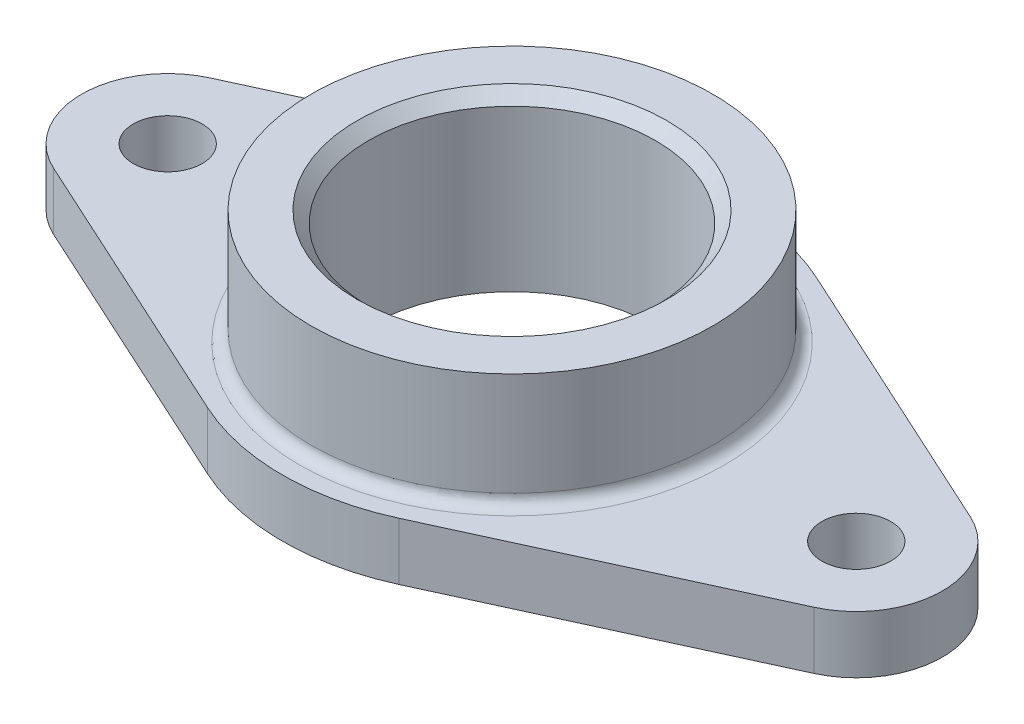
ISO-10303-21;
HEADER;
FILE_DESCRIPTION(('STEP AP214'),'2;1');
FILE_NAME('part.step','',(''),(''),'','','');
FILE_SCHEMA(('AUTOMOTIVE_DESIGN { 1 0 10303 214 1 1 1 1 }'));
ENDSEC;
DATA;
#1=APPLICATION_CONTEXT('core data for automotive mechanical design processes');
#2=APPLICATION_PROTOCOL_DEFINITION('international standard','automotive_design',2000,#1);
#3=PRODUCT_CONTEXT('',#1,'mechanical');
#4=PRODUCT('Part','Part','',(#3));
#5=PRODUCT_RELATED_PRODUCT_CATEGORY('part','',(#4));
#6=PRODUCT_DEFINITION_FORMATION('','',#4);
#7=PRODUCT_DEFINITION_CONTEXT('part definition',#1,'design');
#8=PRODUCT_DEFINITION('design','',#6,#7);
#9=PRODUCT_DEFINITION_SHAPE('','',#8);
#10=(LENGTH_UNIT() NAMED_UNIT(*) SI_UNIT(.MILLI.,.METRE.));
#11=(NAMED_UNIT(*) PLANE_ANGLE_UNIT() SI_UNIT($,.RADIAN.));
#12=(NAMED_UNIT(*) SI_UNIT($,.STERADIAN.) SOLID_ANGLE_UNIT());
#13=UNCERTAINTY_MEASURE_WITH_UNIT(LENGTH_MEASURE(1.E-05),#10,'distance_accuracy_value','');
#14=(GEOMETRIC_REPRESENTATION_CONTEXT(3) GLOBAL_UNCERTAINTY_ASSIGNED_CONTEXT((#13)) GLOBAL_UNIT_ASSIGNED_CONTEXT((#10,
#11,#12)) REPRESENTATION_CONTEXT('',''));
#15=CARTESIAN_POINT('',(0.,0.,0.));
#16=DIRECTION('',(0.,0.,1.));
#17=DIRECTION('',(1.,0.,0.));
#18=AXIS2_PLACEMENT_3D('',#15,#16,#17);
#19=CARTESIAN_POINT('',(-60.,0.,0.));
#20=DIRECTION('',(0.,1.,0.));
#21=DIRECTION('',(0.,0.,1.));
#22=AXIS2_PLACEMENT_3D('',#19,#20,#21);
#23=PLANE('',#22);
#24=CARTESIAN_POINT('',(-60.,0.,0.));
#25=DIRECTION('',(0.,1.,0.));
#26=DIRECTION('',(0.,0.,1.));
#27=AXIS2_PLACEMENT_3D('',#24,#25,#26);
#28=CIRCLE('',#27,6.);
#29=CARTESIAN_POINT('',(-60.,0.,6.));
#30=VERTEX_POINT('',#29);
#31=EDGE_CURVE('E164',#30,#30,#28,.T.);
#32=ORIENTED_EDGE('',*,*,#31,.T.);
#33=EDGE_LOOP('',(#32));
#34=FACE_BOUND('',#33,.T.);
#35=CARTESIAN_POINT('',(-60.,0.,0.));
#36=DIRECTION('',(0.,1.,0.));
#37=DIRECTION('',(0.,0.,1.));
#38=AXIS2_PLACEMENT_3D('',#35,#36,#37);
#39=CIRCLE('',#38,15.);
#40=CARTESIAN_POINT('',(-66.25,0.,-13.6358901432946));
#41=VERTEX_POINT('',#40);
#42=CARTESIAN_POINT('',(-66.25,0.,13.6358901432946));
#43=VERTEX_POINT('',#42);
#44=EDGE_CURVE('E129',#41,#43,#39,.T.);
#45=ORIENTED_EDGE('',*,*,#44,.F.);
#46=DIRECTION('',(-0.90905934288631,0.,0.416666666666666));
#47=VECTOR('',#46,1.);
#48=CARTESIAN_POINT('',(-66.25,0.,-13.6358901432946));
#49=LINE('',#48,#47);
#50=CARTESIAN_POINT('',(-16.6666666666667,0.,-36.3623737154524));
#51=VERTEX_POINT('',#50);
#52=EDGE_CURVE('E82',#51,#41,#49,.T.);
#53=ORIENTED_EDGE('',*,*,#52,.F.);
#54=CARTESIAN_POINT('',(0.,0.,0.));
#55=DIRECTION('',(0.,1.,0.));
#56=DIRECTION('',(0.,0.,1.));
#57=AXIS2_PLACEMENT_3D('',#54,#55,#56);
#58=CIRCLE('',#57,40.);
#59=CARTESIAN_POINT('',(16.6666666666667,0.,-36.3623737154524));
#60=VERTEX_POINT('',#59);
#61=EDGE_CURVE('E76',#60,#51,#58,.T.);
#62=ORIENTED_EDGE('',*,*,#61,.F.);
#63=DIRECTION('',(-0.90905934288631,0.,-0.416666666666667));
#64=VECTOR('',#63,1.);
#65=CARTESIAN_POINT('',(16.6666666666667,0.,-36.3623737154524));
#66=LINE('',#65,#64);
#67=CARTESIAN_POINT('',(66.25,0.,-13.6358901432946));
#68=VERTEX_POINT('',#67);
#69=EDGE_CURVE('E119',#68,#60,#66,.T.);
#70=ORIENTED_EDGE('',*,*,#69,.F.);
#71=CARTESIAN_POINT('',(60.,0.,0.));
#72=DIRECTION('',(0.,1.,0.));
#73=DIRECTION('',(0.,0.,1.));
#74=AXIS2_PLACEMENT_3D('',#71,#72,#73);
#75=CIRCLE('',#74,15.);
#76=CARTESIAN_POINT('',(66.25,0.,13.6358901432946));
#77=VERTEX_POINT('',#76);
#78=EDGE_CURVE('E139',#77,#68,#75,.T.);
#79=ORIENTED_EDGE('',*,*,#78,.F.);
#80=DIRECTION('',(0.90905934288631,0.,-0.416666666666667));
#81=VECTOR('',#80,1.);
#82=CARTESIAN_POINT('',(16.6666666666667,0.,36.3623737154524));
#83=LINE('',#82,#81);
#84=CARTESIAN_POINT('',(16.6666666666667,0.,36.3623737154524));
#85=VERTEX_POINT('',#84);
#86=EDGE_CURVE('E137',#85,#77,#83,.T.);
#87=ORIENTED_EDGE('',*,*,#86,.F.);
#88=CARTESIAN_POINT('',(0.,0.,0.));
#89=DIRECTION('',(0.,1.,0.));
#90=DIRECTION('',(0.,0.,1.));
#91=AXIS2_PLACEMENT_3D('',#88,#89,#90);
#92=CIRCLE('',#91,40.);
#93=CARTESIAN_POINT('',(-16.6666666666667,0.,36.3623737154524));
#94=VERTEX_POINT('',#93);
#95=EDGE_CURVE('E135',#94,#85,#92,.T.);
#96=ORIENTED_EDGE('',*,*,#95,.F.);
#97=DIRECTION('',(0.90905934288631,0.,0.416666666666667));
#98=VECTOR('',#97,1.);
#99=CARTESIAN_POINT('',(-66.25,0.,13.6358901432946));
#100=LINE('',#99,#98);
#101=EDGE_CURVE('E132',#43,#94,#100,.T.);
#102=ORIENTED_EDGE('',*,*,#101,.F.);
#103=EDGE_LOOP('',(#45,#53,#62,#70,#79,#87,#96,#102));
#104=FACE_BOUND('',#103,.T.);
#105=CARTESIAN_POINT('',(0.,0.,0.));
#106=DIRECTION('',(0.,1.,0.));
#107=DIRECTION('',(0.,0.,1.));
#108=AXIS2_PLACEMENT_3D('',#105,#106,#107);
#109=CIRCLE('',#108,25.);
#110=CARTESIAN_POINT('',(0.,0.,25.));
#111=VERTEX_POINT('',#110);
#112=EDGE_CURVE('E163',#111,#111,#109,.T.);
#113=ORIENTED_EDGE('',*,*,#112,.T.);
#114=EDGE_LOOP('',(#113));
#115=FACE_BOUND('',#114,.T.);
#116=CARTESIAN_POINT('',(60.,0.,0.));
#117=DIRECTION('',(0.,1.,0.));
#118=DIRECTION('',(0.,0.,1.));
#119=AXIS2_PLACEMENT_3D('',#116,#117,#118);
#120=CIRCLE('',#119,6.);
#121=CARTESIAN_POINT('',(60.,0.,6.));
#122=VERTEX_POINT('',#121);
#123=EDGE_CURVE('E168',#122,#122,#120,.T.);
#124=ORIENTED_EDGE('',*,*,#123,.T.);
#125=EDGE_LOOP('',(#124));
#126=FACE_BOUND('',#125,.T.);
#127=ADVANCED_FACE('F30',(#34,#104,#115,#126),#23,.F.);
#128=CARTESIAN_POINT('',(-60.,10.,0.));
#129=DIRECTION('',(0.,1.,0.));
#130=DIRECTION('',(0.,0.,1.));
#131=AXIS2_PLACEMENT_3D('',#128,#129,#130);
#132=PLANE('',#131);
#133=CARTESIAN_POINT('',(0.,10.,0.));
#134=DIRECTION('',(0.,1.,0.));
#135=DIRECTION('',(0.,0.,1.));
#136=AXIS2_PLACEMENT_3D('',#133,#134,#135);
#137=CIRCLE('',#136,37.);
#138=CARTESIAN_POINT('',(0.,10.,37.));
#139=VERTEX_POINT('',#138);
#140=EDGE_CURVE('E39',#139,#139,#137,.F.);
#141=ORIENTED_EDGE('',*,*,#140,.T.);
#142=EDGE_LOOP('',(#141));
#143=FACE_BOUND('',#142,.T.);
#144=CARTESIAN_POINT('',(-60.,10.,0.));
#145=DIRECTION('',(0.,1.,0.));
#146=DIRECTION('',(0.,0.,1.));
#147=AXIS2_PLACEMENT_3D('',#144,#145,#146);
#148=CIRCLE('',#147,6.);
#149=CARTESIAN_POINT('',(-60.,10.,6.));
#150=VERTEX_POINT('',#149);
#151=EDGE_CURVE('E160',#150,#150,#148,.F.);
#152=ORIENTED_EDGE('',*,*,#151,.T.);
#153=EDGE_LOOP('',(#152));
#154=FACE_BOUND('',#153,.T.);
#155=CARTESIAN_POINT('',(-60.,10.,0.));
#156=DIRECTION('',(0.,1.,0.));
#157=DIRECTION('',(0.,0.,1.));
#158=AXIS2_PLACEMENT_3D('',#155,#156,#157);
#159=CIRCLE('',#158,15.);
#160=CARTESIAN_POINT('',(-66.25,10.,-13.6358901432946));
#161=VERTEX_POINT('',#160);
#162=CARTESIAN_POINT('',(-66.25,10.,13.6358901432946));
#163=VERTEX_POINT('',#162);
#164=EDGE_CURVE('E144',#161,#163,#159,.T.);
#165=ORIENTED_EDGE('',*,*,#164,.T.);
#166=DIRECTION('',(0.90905934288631,0.,0.416666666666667));
#167=VECTOR('',#166,1.);
#168=CARTESIAN_POINT('',(-66.25,10.,13.6358901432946));
#169=LINE('',#168,#167);
#170=CARTESIAN_POINT('',(-16.6666666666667,10.,36.3623737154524));
#171=VERTEX_POINT('',#170);
#172=EDGE_CURVE('E91',#163,#171,#169,.T.);
#173=ORIENTED_EDGE('',*,*,#172,.T.);
#174=CARTESIAN_POINT('',(0.,10.,0.));
#175=DIRECTION('',(0.,1.,0.));
#176=DIRECTION('',(0.,0.,1.));
#177=AXIS2_PLACEMENT_3D('',#174,#175,#176);
#178=CIRCLE('',#177,40.);
#179=CARTESIAN_POINT('',(16.6666666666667,10.,36.3623737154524));
#180=VERTEX_POINT('',#179);
#181=EDGE_CURVE('E238',#171,#180,#178,.T.);
#182=ORIENTED_EDGE('',*,*,#181,.T.);
#183=DIRECTION('',(0.90905934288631,0.,-0.416666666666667));
#184=VECTOR('',#183,1.);
#185=CARTESIAN_POINT('',(16.6666666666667,10.,36.3623737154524));
#186=LINE('',#185,#184);
#187=CARTESIAN_POINT('',(66.25,10.,13.6358901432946));
#188=VERTEX_POINT('',#187);
#189=EDGE_CURVE('E240',#180,#188,#186,.T.);
#190=ORIENTED_EDGE('',*,*,#189,.T.);
#191=CARTESIAN_POINT('',(60.,10.,0.));
#192=DIRECTION('',(0.,1.,0.));
#193=DIRECTION('',(0.,0.,1.));
#194=AXIS2_PLACEMENT_3D('',#191,#192,#193);
#195=CIRCLE('',#194,15.);
#196=CARTESIAN_POINT('',(66.25,10.,-13.6358901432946));
#197=VERTEX_POINT('',#196);
#198=EDGE_CURVE('E111',#188,#197,#195,.T.);
#199=ORIENTED_EDGE('',*,*,#198,.T.);
#200=DIRECTION('',(-0.90905934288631,0.,-0.416666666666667));
#201=VECTOR('',#200,1.);
#202=CARTESIAN_POINT('',(16.6666666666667,10.,-36.3623737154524));
#203=LINE('',#202,#201);
#204=CARTESIAN_POINT('',(16.6666666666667,10.,-36.3623737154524));
#205=VERTEX_POINT('',#204);
#206=EDGE_CURVE('E104',#197,#205,#203,.T.);
#207=ORIENTED_EDGE('',*,*,#206,.T.);
#208=CARTESIAN_POINT('',(0.,10.,0.));
#209=DIRECTION('',(0.,1.,0.));
#210=DIRECTION('',(0.,0.,1.));
#211=AXIS2_PLACEMENT_3D('',#208,#209,#210);
#212=CIRCLE('',#211,40.);
#213=CARTESIAN_POINT('',(-16.6666666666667,10.,-36.3623737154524));
#214=VERTEX_POINT('',#213);
#215=EDGE_CURVE('E109',#205,#214,#212,.T.);
#216=ORIENTED_EDGE('',*,*,#215,.T.);
#217=DIRECTION('',(-0.90905934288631,0.,0.416666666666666));
#218=VECTOR('',#217,1.);
#219=CARTESIAN_POINT('',(-66.25,10.,-13.6358901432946));
#220=LINE('',#219,#218);
#221=EDGE_CURVE('E47',#214,#161,#220,.T.);
#222=ORIENTED_EDGE('',*,*,#221,.T.);
#223=EDGE_LOOP('',(#165,#173,#182,#190,#199,#207,#216,#222));
#224=FACE_BOUND('',#223,.T.);
#225=CARTESIAN_POINT('',(60.,10.,0.));
#226=DIRECTION('',(0.,1.,0.));
#227=DIRECTION('',(0.,0.,1.));
#228=AXIS2_PLACEMENT_3D('',#225,#226,#227);
#229=CIRCLE('',#228,6.);
#230=CARTESIAN_POINT('',(60.,10.,6.));
#231=VERTEX_POINT('',#230);
#232=EDGE_CURVE('E165',#231,#231,#229,.F.);
#233=ORIENTED_EDGE('',*,*,#232,.T.);
#234=EDGE_LOOP('',(#233));
#235=FACE_BOUND('',#234,.T.);
#236=ADVANCED_FACE('F106',(#143,#154,#224,#235),#132,.T.);
#237=CARTESIAN_POINT('',(0.,30.,0.));
#238=DIRECTION('',(0.,1.,0.));
#239=DIRECTION('',(0.,0.,1.));
#240=AXIS2_PLACEMENT_3D('',#237,#238,#239);
#241=PLANE('',#240);
#242=CARTESIAN_POINT('',(0.,30.,0.));
#243=DIRECTION('',(0.,1.,0.));
#244=DIRECTION('',(0.,0.,1.));
#245=AXIS2_PLACEMENT_3D('',#242,#243,#244);
#246=CIRCLE('',#245,27.);
#247=CARTESIAN_POINT('',(0.,30.,27.));
#248=VERTEX_POINT('',#247);
#249=EDGE_CURVE('E171',#248,#248,#246,.F.);
#250=ORIENTED_EDGE('',*,*,#249,.T.);
#251=EDGE_LOOP('',(#250));
#252=FACE_BOUND('',#251,.T.);
#253=CARTESIAN_POINT('',(0.,30.,0.));
#254=DIRECTION('',(0.,1.,0.));
#255=DIRECTION('',(0.,0.,1.));
#256=AXIS2_PLACEMENT_3D('',#253,#254,#255);
#257=CIRCLE('',#256,35.);
#258=CARTESIAN_POINT('',(0.,30.,35.));
#259=VERTEX_POINT('',#258);
#260=EDGE_CURVE('E133',#259,#259,#257,.T.);
#261=ORIENTED_EDGE('',*,*,#260,.T.);
#262=EDGE_LOOP('',(#261));
#263=FACE_BOUND('',#262,.T.);
#264=ADVANCED_FACE('F193',(#252,#263),#241,.T.);
#265=CARTESIAN_POINT('',(-60.,10.,0.));
#266=DIRECTION('',(0.,-1.,0.));
#267=DIRECTION('',(0.,0.,-1.));
#268=AXIS2_PLACEMENT_3D('',#265,#266,#267);
#269=CYLINDRICAL_SURFACE('',#268,15.);
#270=ORIENTED_EDGE('',*,*,#44,.T.);
#271=DIRECTION('',(0.,-1.,0.));
#272=VECTOR('',#271,1.);
#273=CARTESIAN_POINT('',(-66.25,10.,13.6358901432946));
#274=LINE('',#273,#272);
#275=EDGE_CURVE('E157',#163,#43,#274,.T.);
#276=ORIENTED_EDGE('',*,*,#275,.F.);
#277=ORIENTED_EDGE('',*,*,#164,.F.);
#278=DIRECTION('',(0.,-1.,0.));
#279=VECTOR('',#278,1.);
#280=CARTESIAN_POINT('',(-66.25,10.,-13.6358901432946));
#281=LINE('',#280,#279);
#282=EDGE_CURVE('E125',#161,#41,#281,.T.);
#283=ORIENTED_EDGE('',*,*,#282,.T.);
#284=EDGE_LOOP('',(#270,#276,#277,#283));
#285=FACE_BOUND('',#284,.T.);
#286=ADVANCED_FACE('F222',(#285),#269,.T.);
#287=CARTESIAN_POINT('',(-66.25,10.,13.6358901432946));
#288=DIRECTION('',(0.416666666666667,0.,-0.90905934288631));
#289=DIRECTION('',(-0.90905934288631,0.,-0.416666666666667));
#290=AXIS2_PLACEMENT_3D('',#287,#288,#289);
#291=PLANE('',#290);
#292=ORIENTED_EDGE('',*,*,#101,.T.);
#293=DIRECTION('',(0.,-1.,0.));
#294=VECTOR('',#293,1.);
#295=CARTESIAN_POINT('',(-16.6666666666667,10.,36.3623737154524));
#296=LINE('',#295,#294);
#297=EDGE_CURVE('E154',#171,#94,#296,.T.);
#298=ORIENTED_EDGE('',*,*,#297,.F.);
#299=ORIENTED_EDGE('',*,*,#172,.F.);
#300=ORIENTED_EDGE('',*,*,#275,.T.);
#301=EDGE_LOOP('',(#292,#298,#299,#300));
#302=FACE_BOUND('',#301,.T.);
#303=ADVANCED_FACE('F218',(#302),#291,.F.);
#304=CARTESIAN_POINT('',(0.,10.,0.));
#305=DIRECTION('',(0.,-1.,0.));
#306=DIRECTION('',(0.,0.,-1.));
#307=AXIS2_PLACEMENT_3D('',#304,#305,#306);
#308=CYLINDRICAL_SURFACE('',#307,40.);
#309=ORIENTED_EDGE('',*,*,#95,.T.);
#310=DIRECTION('',(0.,-1.,0.));
#311=VECTOR('',#310,1.);
#312=CARTESIAN_POINT('',(16.6666666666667,10.,36.3623737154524));
#313=LINE('',#312,#311);
#314=EDGE_CURVE('E151',#180,#85,#313,.T.);
#315=ORIENTED_EDGE('',*,*,#314,.F.);
#316=ORIENTED_EDGE('',*,*,#181,.F.);
#317=ORIENTED_EDGE('',*,*,#297,.T.);
#318=EDGE_LOOP('',(#309,#315,#316,#317));
#319=FACE_BOUND('',#318,.T.);
#320=ADVANCED_FACE('F214',(#319),#308,.T.);
#321=CARTESIAN_POINT('',(16.6666666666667,10.,36.3623737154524));
#322=DIRECTION('',(-0.416666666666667,0.,-0.90905934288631));
#323=DIRECTION('',(-0.90905934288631,0.,0.416666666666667));
#324=AXIS2_PLACEMENT_3D('',#321,#322,#323);
#325=PLANE('',#324);
#326=ORIENTED_EDGE('',*,*,#86,.T.);
#327=DIRECTION('',(0.,-1.,0.));
#328=VECTOR('',#327,1.);
#329=CARTESIAN_POINT('',(66.25,10.,13.6358901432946));
#330=LINE('',#329,#328);
#331=EDGE_CURVE('E148',#188,#77,#330,.T.);
#332=ORIENTED_EDGE('',*,*,#331,.F.);
#333=ORIENTED_EDGE('',*,*,#189,.F.);
#334=ORIENTED_EDGE('',*,*,#314,.T.);
#335=EDGE_LOOP('',(#326,#332,#333,#334));
#336=FACE_BOUND('',#335,.T.);
#337=ADVANCED_FACE('F210',(#336),#325,.F.);
#338=CARTESIAN_POINT('',(60.,10.,0.));
#339=DIRECTION('',(0.,-1.,0.));
#340=DIRECTION('',(0.,0.,-1.));
#341=AXIS2_PLACEMENT_3D('',#338,#339,#340);
#342=CYLINDRICAL_SURFACE('',#341,15.);
#343=ORIENTED_EDGE('',*,*,#78,.T.);
#344=DIRECTION('',(0.,-1.,0.));
#345=VECTOR('',#344,1.);
#346=CARTESIAN_POINT('',(66.25,10.,-13.6358901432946));
#347=LINE('',#346,#345);
#348=EDGE_CURVE('E120',#197,#68,#347,.T.);
#349=ORIENTED_EDGE('',*,*,#348,.F.);
#350=ORIENTED_EDGE('',*,*,#198,.F.);
#351=ORIENTED_EDGE('',*,*,#331,.T.);
#352=EDGE_LOOP('',(#343,#349,#350,#351));
#353=FACE_BOUND('',#352,.T.);
#354=ADVANCED_FACE('F207',(#353),#342,.T.);
#355=CARTESIAN_POINT('',(16.6666666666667,10.,-36.3623737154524));
#356=DIRECTION('',(-0.416666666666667,0.,0.90905934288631));
#357=DIRECTION('',(0.90905934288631,0.,0.416666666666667));
#358=AXIS2_PLACEMENT_3D('',#355,#356,#357);
#359=PLANE('',#358);
#360=ORIENTED_EDGE('',*,*,#69,.T.);
#361=DIRECTION('',(0.,-1.,0.));
#362=VECTOR('',#361,1.);
#363=CARTESIAN_POINT('',(16.6666666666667,10.,-36.3623737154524));
#364=LINE('',#363,#362);
#365=EDGE_CURVE('E116',#205,#60,#364,.T.);
#366=ORIENTED_EDGE('',*,*,#365,.F.);
#367=ORIENTED_EDGE('',*,*,#206,.F.);
#368=ORIENTED_EDGE('',*,*,#348,.T.);
#369=EDGE_LOOP('',(#360,#366,#367,#368));
#370=FACE_BOUND('',#369,.T.);
#371=ADVANCED_FACE('F117',(#370),#359,.F.);
#372=CARTESIAN_POINT('',(0.,10.,0.));
#373=DIRECTION('',(0.,-1.,0.));
#374=DIRECTION('',(0.,0.,-1.));
#375=AXIS2_PLACEMENT_3D('',#372,#373,#374);
#376=CYLINDRICAL_SURFACE('',#375,40.);
#377=ORIENTED_EDGE('',*,*,#61,.T.);
#378=DIRECTION('',(0.,-1.,0.));
#379=VECTOR('',#378,1.);
#380=CARTESIAN_POINT('',(-16.6666666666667,10.,-36.3623737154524));
#381=LINE('',#380,#379);
#382=EDGE_CURVE('E121',#214,#51,#381,.T.);
#383=ORIENTED_EDGE('',*,*,#382,.F.);
#384=ORIENTED_EDGE('',*,*,#215,.F.);
#385=ORIENTED_EDGE('',*,*,#365,.T.);
#386=EDGE_LOOP('',(#377,#383,#384,#385));
#387=FACE_BOUND('',#386,.T.);
#388=ADVANCED_FACE('F123',(#387),#376,.T.);
#389=CARTESIAN_POINT('',(-66.25,10.,-13.6358901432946));
#390=DIRECTION('',(0.416666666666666,0.,0.90905934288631));
#391=DIRECTION('',(0.90905934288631,0.,-0.416666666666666));
#392=AXIS2_PLACEMENT_3D('',#389,#390,#391);
#393=PLANE('',#392);
#394=ORIENTED_EDGE('',*,*,#52,.T.);
#395=ORIENTED_EDGE('',*,*,#282,.F.);
#396=ORIENTED_EDGE('',*,*,#221,.F.);
#397=ORIENTED_EDGE('',*,*,#382,.T.);
#398=EDGE_LOOP('',(#394,#395,#396,#397));
#399=FACE_BOUND('',#398,.T.);
#400=ADVANCED_FACE('F199',(#399),#393,.F.);
#401=CARTESIAN_POINT('',(0.,30.,0.));
#402=DIRECTION('',(0.,-1.,0.));
#403=DIRECTION('',(0.,0.,-1.));
#404=AXIS2_PLACEMENT_3D('',#401,#402,#403);
#405=CYLINDRICAL_SURFACE('',#404,35.);
#406=CARTESIAN_POINT('',(0.,12.,0.));
#407=DIRECTION('',(0.,1.,0.));
#408=DIRECTION('',(0.,0.,1.));
#409=AXIS2_PLACEMENT_3D('',#406,#407,#408);
#410=CIRCLE('',#409,35.);
#411=CARTESIAN_POINT('',(0.,12.,35.));
#412=VERTEX_POINT('',#411);
#413=EDGE_CURVE('E11',#412,#412,#410,.T.);
#414=ORIENTED_EDGE('',*,*,#413,.T.);
#415=EDGE_LOOP('',(#414));
#416=FACE_BOUND('',#415,.T.);
#417=ORIENTED_EDGE('',*,*,#260,.F.);
#418=EDGE_LOOP('',(#417));
#419=FACE_BOUND('',#418,.T.);
#420=ADVANCED_FACE('F202',(#416,#419),#405,.T.);
#421=CARTESIAN_POINT('',(0.,30.,0.));
#422=DIRECTION('',(0.,-1.,0.));
#423=DIRECTION('',(0.,0.,-1.));
#424=AXIS2_PLACEMENT_3D('',#421,#422,#423);
#425=CYLINDRICAL_SURFACE('',#424,25.);
#426=CARTESIAN_POINT('',(0.,28.,0.));
#427=DIRECTION('',(0.,1.,0.));
#428=DIRECTION('',(0.,0.,1.));
#429=AXIS2_PLACEMENT_3D('',#426,#427,#428);
#430=CIRCLE('',#429,25.);
#431=CARTESIAN_POINT('',(0.,28.,25.));
#432=VERTEX_POINT('',#431);
#433=EDGE_CURVE('E159',#432,#432,#430,.T.);
#434=ORIENTED_EDGE('',*,*,#433,.T.);
#435=EDGE_LOOP('',(#434));
#436=FACE_BOUND('',#435,.T.);
#437=ORIENTED_EDGE('',*,*,#112,.F.);
#438=EDGE_LOOP('',(#437));
#439=FACE_BOUND('',#438,.T.);
#440=ADVANCED_FACE('F262',(#436,#439),#425,.F.);
#441=CARTESIAN_POINT('',(-60.,30.,0.));
#442=DIRECTION('',(0.,-1.,0.));
#443=DIRECTION('',(0.,0.,-1.));
#444=AXIS2_PLACEMENT_3D('',#441,#442,#443);
#445=CYLINDRICAL_SURFACE('',#444,6.);
#446=ORIENTED_EDGE('',*,*,#151,.F.);
#447=EDGE_LOOP('',(#446));
#448=FACE_BOUND('',#447,.T.);
#449=ORIENTED_EDGE('',*,*,#31,.F.);
#450=EDGE_LOOP('',(#449));
#451=FACE_BOUND('',#450,.T.);
#452=ADVANCED_FACE('F256',(#448,#451),#445,.F.);
#453=CARTESIAN_POINT('',(60.,30.,0.));
#454=DIRECTION('',(0.,-1.,0.));
#455=DIRECTION('',(0.,0.,-1.));
#456=AXIS2_PLACEMENT_3D('',#453,#454,#455);
#457=CYLINDRICAL_SURFACE('',#456,6.);
#458=ORIENTED_EDGE('',*,*,#232,.F.);
#459=EDGE_LOOP('',(#458));
#460=FACE_BOUND('',#459,.T.);
#461=ORIENTED_EDGE('',*,*,#123,.F.);
#462=EDGE_LOOP('',(#461));
#463=FACE_BOUND('',#462,.T.);
#464=ADVANCED_FACE('F184',(#460,#463),#457,.F.);
#465=CARTESIAN_POINT('',(0.,28.,0.));
#466=DIRECTION('',(0.,1.,0.));
#467=DIRECTION('',(0.,0.,1.));
#468=AXIS2_PLACEMENT_3D('',#465,#466,#467);
#469=CONICAL_SURFACE('',#468,25.,0.785398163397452);
#470=ORIENTED_EDGE('',*,*,#249,.F.);
#471=EDGE_LOOP('',(#470));
#472=FACE_BOUND('',#471,.T.);
#473=ORIENTED_EDGE('',*,*,#433,.F.);
#474=EDGE_LOOP('',(#473));
#475=FACE_BOUND('',#474,.T.);
#476=ADVANCED_FACE('F179',(#472,#475),#469,.F.);
#477=CARTESIAN_POINT('',(0.,12.,0.));
#478=DIRECTION('',(0.,1.,0.));
#479=DIRECTION('',(0.,0.,1.));
#480=AXIS2_PLACEMENT_3D('',#477,#478,#479);
#481=TOROIDAL_SURFACE('',#480,37.,2.);
#482=ORIENTED_EDGE('',*,*,#413,.F.);
#483=EDGE_LOOP('',(#482));
#484=FACE_BOUND('',#483,.T.);
#485=ORIENTED_EDGE('',*,*,#140,.F.);
#486=EDGE_LOOP('',(#485));
#487=FACE_BOUND('',#486,.T.);
#488=ADVANCED_FACE('F32',(#484,#487),#481,.F.);
#489=CLOSED_SHELL('',(#127,#236,#264,#286,#303,#320,#337,#354,#371,#388,#400,#420,#440,#452,
#464,#476,#488));
#490=MANIFOLD_SOLID_BREP('B2',#489);
#491=ADVANCED_BREP_SHAPE_REPRESENTATION('',(#18,#490),#14);
#492=SHAPE_DEFINITION_REPRESENTATION(#9,#491);
ENDSEC;
END-ISO-10303-21;
